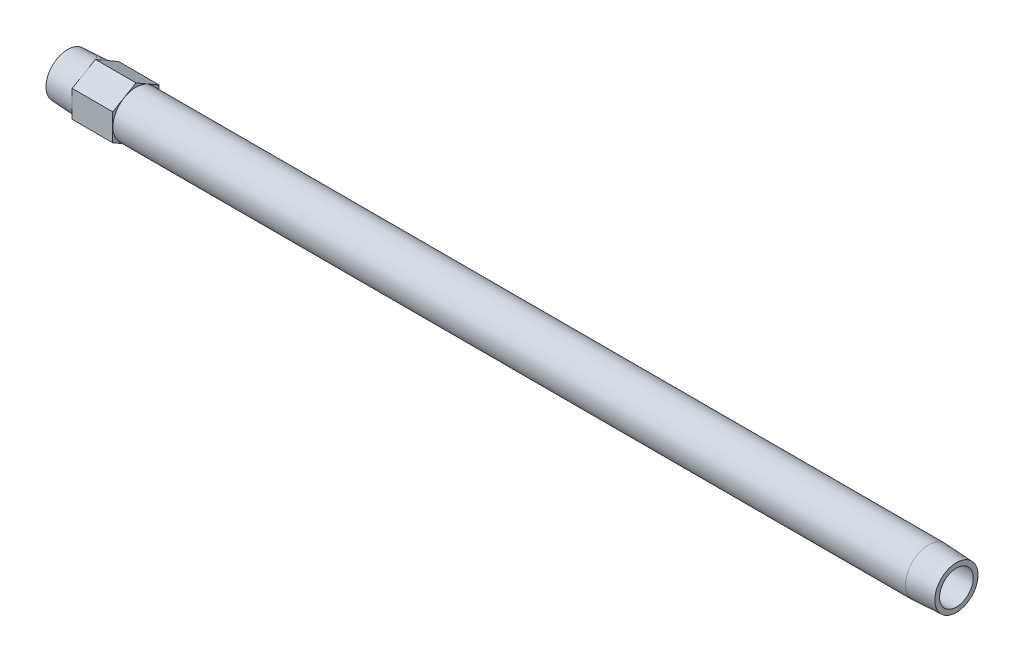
ISO-10303-21;
HEADER;
FILE_DESCRIPTION(('STEP AP214'),'2;1');
FILE_NAME('part.step','',(''),(''),'','','');
FILE_SCHEMA(('AUTOMOTIVE_DESIGN { 1 0 10303 214 1 1 1 1 }'));
ENDSEC;
DATA;
#1=APPLICATION_CONTEXT('core data for automotive mechanical design processes');
#2=APPLICATION_PROTOCOL_DEFINITION('international standard','automotive_design',2000,#1);
#3=PRODUCT_CONTEXT('',#1,'mechanical');
#4=PRODUCT('Part','Part','',(#3));
#5=PRODUCT_RELATED_PRODUCT_CATEGORY('part','',(#4));
#6=PRODUCT_DEFINITION_FORMATION('','',#4);
#7=PRODUCT_DEFINITION_CONTEXT('part definition',#1,'design');
#8=PRODUCT_DEFINITION('design','',#6,#7);
#9=PRODUCT_DEFINITION_SHAPE('','',#8);
#10=(LENGTH_UNIT() NAMED_UNIT(*) SI_UNIT(.MILLI.,.METRE.));
#11=(NAMED_UNIT(*) PLANE_ANGLE_UNIT() SI_UNIT($,.RADIAN.));
#12=(NAMED_UNIT(*) SI_UNIT($,.STERADIAN.) SOLID_ANGLE_UNIT());
#13=UNCERTAINTY_MEASURE_WITH_UNIT(LENGTH_MEASURE(1.E-05),#10,'distance_accuracy_value','');
#14=(GEOMETRIC_REPRESENTATION_CONTEXT(3) GLOBAL_UNCERTAINTY_ASSIGNED_CONTEXT((#13)) GLOBAL_UNIT_ASSIGNED_CONTEXT((#10,
#11,#12)) REPRESENTATION_CONTEXT('',''));
#15=CARTESIAN_POINT('',(0.,0.,0.));
#16=DIRECTION('',(0.,0.,1.));
#17=DIRECTION('',(1.,0.,0.));
#18=AXIS2_PLACEMENT_3D('',#15,#16,#17);
#19=CARTESIAN_POINT('',(0.,0.,-8.03071885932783));
#20=DIRECTION('',(1.,0.,0.));
#21=DIRECTION('',(0.,0.,-1.));
#22=AXIS2_PLACEMENT_3D('',#19,#20,#21);
#23=PLANE('',#22);
#24=CARTESIAN_POINT('',(0.,0.,0.));
#25=DIRECTION('',(-1.,0.,0.));
#26=DIRECTION('',(0.,0.,1.));
#27=AXIS2_PLACEMENT_3D('',#24,#25,#26);
#28=CIRCLE('',#27,8.03071885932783);
#29=CARTESIAN_POINT('',(0.,0.,8.03071885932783));
#30=VERTEX_POINT('',#29);
#31=EDGE_CURVE('E147',#30,#30,#28,.T.);
#32=ORIENTED_EDGE('',*,*,#31,.T.);
#33=EDGE_LOOP('',(#32));
#34=FACE_BOUND('',#33,.T.);
#35=CARTESIAN_POINT('',(0.,0.,0.));
#36=DIRECTION('',(1.,0.,0.));
#37=DIRECTION('',(0.,0.,1.));
#38=AXIS2_PLACEMENT_3D('',#35,#36,#37);
#39=CIRCLE('',#38,6.2611);
#40=CARTESIAN_POINT('',(0.,0.,6.2611));
#41=VERTEX_POINT('',#40);
#42=EDGE_CURVE('E159',#41,#41,#39,.T.);
#43=ORIENTED_EDGE('',*,*,#42,.T.);
#44=EDGE_LOOP('',(#43));
#45=FACE_BOUND('',#44,.T.);
#46=ADVANCED_FACE('F15',(#34,#45),#23,.F.);
#47=CARTESIAN_POINT('',(330.2,0.,-8.0307188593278));
#48=DIRECTION('',(-1.,0.,0.));
#49=DIRECTION('',(0.,0.,1.));
#50=AXIS2_PLACEMENT_3D('',#47,#48,#49);
#51=PLANE('',#50);
#52=CARTESIAN_POINT('',(330.2,0.,0.));
#53=DIRECTION('',(-1.,0.,0.));
#54=DIRECTION('',(0.,0.,1.));
#55=AXIS2_PLACEMENT_3D('',#52,#53,#54);
#56=CIRCLE('',#55,8.0307188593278);
#57=CARTESIAN_POINT('',(330.2,0.,8.0307188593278));
#58=VERTEX_POINT('',#57);
#59=EDGE_CURVE('E150',#58,#58,#56,.T.);
#60=ORIENTED_EDGE('',*,*,#59,.F.);
#61=EDGE_LOOP('',(#60));
#62=FACE_BOUND('',#61,.T.);
#63=CARTESIAN_POINT('',(330.2,0.,0.));
#64=DIRECTION('',(-1.,0.,0.));
#65=DIRECTION('',(0.,0.,1.));
#66=AXIS2_PLACEMENT_3D('',#63,#64,#65);
#67=CIRCLE('',#66,6.2611);
#68=CARTESIAN_POINT('',(330.2,0.,6.2611));
#69=VERTEX_POINT('',#68);
#70=EDGE_CURVE('E156',#69,#69,#67,.F.);
#71=ORIENTED_EDGE('',*,*,#70,.F.);
#72=EDGE_LOOP('',(#71));
#73=FACE_BOUND('',#72,.T.);
#74=ADVANCED_FACE('F178',(#62,#73),#51,.F.);
#75=CARTESIAN_POINT('',(25.4,-4.9859969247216,-8.636));
#76=DIRECTION('',(1.,0.,0.));
#77=DIRECTION('',(0.,1.,0.));
#78=AXIS2_PLACEMENT_3D('',#75,#76,#77);
#79=PLANE('',#78);
#80=DIRECTION('',(0.,0.5,-0.866025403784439));
#81=VECTOR('',#80,1.);
#82=CARTESIAN_POINT('',(25.4,-9.97199384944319,0.));
#83=LINE('',#82,#81);
#84=CARTESIAN_POINT('',(25.4,-9.97199384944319,0.));
#85=VERTEX_POINT('',#84);
#86=CARTESIAN_POINT('',(25.4,-4.9859969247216,-8.636));
#87=VERTEX_POINT('',#86);
#88=EDGE_CURVE('E103',#85,#87,#83,.T.);
#89=ORIENTED_EDGE('',*,*,#88,.T.);
#90=DIRECTION('',(0.,1.,0.));
#91=VECTOR('',#90,1.);
#92=CARTESIAN_POINT('',(25.4,-4.9859969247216,-8.636));
#93=LINE('',#92,#91);
#94=CARTESIAN_POINT('',(25.4,4.9859969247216,-8.636));
#95=VERTEX_POINT('',#94);
#96=EDGE_CURVE('E83',#87,#95,#93,.T.);
#97=ORIENTED_EDGE('',*,*,#96,.T.);
#98=DIRECTION('',(0.,0.5,0.866025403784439));
#99=VECTOR('',#98,1.);
#100=CARTESIAN_POINT('',(25.4,4.9859969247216,-8.636));
#101=LINE('',#100,#99);
#102=CARTESIAN_POINT('',(25.4,9.97199384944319,0.));
#103=VERTEX_POINT('',#102);
#104=EDGE_CURVE('E102',#95,#103,#101,.T.);
#105=ORIENTED_EDGE('',*,*,#104,.T.);
#106=DIRECTION('',(0.,-0.5,0.866025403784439));
#107=VECTOR('',#106,1.);
#108=CARTESIAN_POINT('',(25.4,9.97199384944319,0.));
#109=LINE('',#108,#107);
#110=CARTESIAN_POINT('',(25.4,4.9859969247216,8.636));
#111=VERTEX_POINT('',#110);
#112=EDGE_CURVE('E105',#103,#111,#109,.T.);
#113=ORIENTED_EDGE('',*,*,#112,.T.);
#114=DIRECTION('',(0.,-1.,0.));
#115=VECTOR('',#114,1.);
#116=CARTESIAN_POINT('',(25.4,4.9859969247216,8.636));
#117=LINE('',#116,#115);
#118=CARTESIAN_POINT('',(25.4,-4.9859969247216,8.636));
#119=VERTEX_POINT('',#118);
#120=EDGE_CURVE('E35',#111,#119,#117,.T.);
#121=ORIENTED_EDGE('',*,*,#120,.T.);
#122=DIRECTION('',(0.,-0.5,-0.866025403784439));
#123=VECTOR('',#122,1.);
#124=CARTESIAN_POINT('',(25.4,-4.9859969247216,8.636));
#125=LINE('',#124,#123);
#126=EDGE_CURVE('E30',#119,#85,#125,.T.);
#127=ORIENTED_EDGE('',*,*,#126,.T.);
#128=EDGE_LOOP('',(#89,#97,#105,#113,#121,#127));
#129=FACE_BOUND('',#128,.T.);
#130=CARTESIAN_POINT('',(25.4,0.,0.));
#131=DIRECTION('',(1.,0.,0.));
#132=DIRECTION('',(0.,1.,0.));
#133=AXIS2_PLACEMENT_3D('',#130,#131,#132);
#134=CIRCLE('',#133,8.5725);
#135=CARTESIAN_POINT('',(25.4,8.5725,0.));
#136=VERTEX_POINT('',#135);
#137=EDGE_CURVE('E89',#136,#136,#134,.F.);
#138=ORIENTED_EDGE('',*,*,#137,.T.);
#139=EDGE_LOOP('',(#138));
#140=FACE_BOUND('',#139,.T.);
#141=ADVANCED_FACE('F124',(#129,#140),#79,.T.);
#142=CARTESIAN_POINT('',(10.3378,-4.9859969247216,-8.636));
#143=DIRECTION('',(1.,0.,0.));
#144=DIRECTION('',(0.,1.,0.));
#145=AXIS2_PLACEMENT_3D('',#142,#143,#144);
#146=PLANE('',#145);
#147=DIRECTION('',(0.,0.5,-0.866025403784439));
#148=VECTOR('',#147,1.);
#149=CARTESIAN_POINT('',(10.3378,-9.97199384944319,0.));
#150=LINE('',#149,#148);
#151=CARTESIAN_POINT('',(10.3378,-9.97199384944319,0.));
#152=VERTEX_POINT('',#151);
#153=CARTESIAN_POINT('',(10.3378,-4.9859969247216,-8.636));
#154=VERTEX_POINT('',#153);
#155=EDGE_CURVE('E73',#152,#154,#150,.T.);
#156=ORIENTED_EDGE('',*,*,#155,.F.);
#157=DIRECTION('',(0.,-0.5,-0.866025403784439));
#158=VECTOR('',#157,1.);
#159=CARTESIAN_POINT('',(10.3378,-4.9859969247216,8.636));
#160=LINE('',#159,#158);
#161=CARTESIAN_POINT('',(10.3378,-4.9859969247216,8.636));
#162=VERTEX_POINT('',#161);
#163=EDGE_CURVE('E99',#162,#152,#160,.T.);
#164=ORIENTED_EDGE('',*,*,#163,.F.);
#165=DIRECTION('',(0.,-1.,0.));
#166=VECTOR('',#165,1.);
#167=CARTESIAN_POINT('',(10.3378,4.9859969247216,8.636));
#168=LINE('',#167,#166);
#169=CARTESIAN_POINT('',(10.3378,4.9859969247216,8.636));
#170=VERTEX_POINT('',#169);
#171=EDGE_CURVE('E133',#170,#162,#168,.T.);
#172=ORIENTED_EDGE('',*,*,#171,.F.);
#173=DIRECTION('',(0.,-0.5,0.866025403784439));
#174=VECTOR('',#173,1.);
#175=CARTESIAN_POINT('',(10.3378,9.97199384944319,0.));
#176=LINE('',#175,#174);
#177=CARTESIAN_POINT('',(10.3378,9.97199384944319,0.));
#178=VERTEX_POINT('',#177);
#179=EDGE_CURVE('E129',#178,#170,#176,.T.);
#180=ORIENTED_EDGE('',*,*,#179,.F.);
#181=DIRECTION('',(0.,0.5,0.866025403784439));
#182=VECTOR('',#181,1.);
#183=CARTESIAN_POINT('',(10.3378,4.9859969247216,-8.636));
#184=LINE('',#183,#182);
#185=CARTESIAN_POINT('',(10.3378,4.9859969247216,-8.636));
#186=VERTEX_POINT('',#185);
#187=EDGE_CURVE('E75',#186,#178,#184,.T.);
#188=ORIENTED_EDGE('',*,*,#187,.F.);
#189=DIRECTION('',(0.,1.,0.));
#190=VECTOR('',#189,1.);
#191=CARTESIAN_POINT('',(10.3378,-4.9859969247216,-8.636));
#192=LINE('',#191,#190);
#193=EDGE_CURVE('E68',#154,#186,#192,.T.);
#194=ORIENTED_EDGE('',*,*,#193,.F.);
#195=EDGE_LOOP('',(#156,#164,#172,#180,#188,#194));
#196=FACE_BOUND('',#195,.T.);
#197=CARTESIAN_POINT('',(10.3378,0.,0.));
#198=DIRECTION('',(-1.,0.,0.));
#199=DIRECTION('',(0.,0.,1.));
#200=AXIS2_PLACEMENT_3D('',#197,#198,#199);
#201=CIRCLE('',#200,8.5725);
#202=CARTESIAN_POINT('',(10.3378,0.,8.5725));
#203=VERTEX_POINT('',#202);
#204=EDGE_CURVE('E95',#203,#203,#201,.T.);
#205=ORIENTED_EDGE('',*,*,#204,.F.);
#206=EDGE_LOOP('',(#205));
#207=FACE_BOUND('',#206,.T.);
#208=ADVANCED_FACE('F69',(#196,#207),#146,.F.);
#209=CARTESIAN_POINT('',(25.4,-9.97199384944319,0.));
#210=DIRECTION('',(0.,0.866025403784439,0.5));
#211=DIRECTION('',(0.,-0.5,0.866025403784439));
#212=AXIS2_PLACEMENT_3D('',#209,#210,#211);
#213=PLANE('',#212);
#214=ORIENTED_EDGE('',*,*,#155,.T.);
#215=DIRECTION('',(-1.,0.,0.));
#216=VECTOR('',#215,1.);
#217=CARTESIAN_POINT('',(25.4,-4.9859969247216,-8.636));
#218=LINE('',#217,#216);
#219=EDGE_CURVE('E10',#87,#154,#218,.T.);
#220=ORIENTED_EDGE('',*,*,#219,.F.);
#221=ORIENTED_EDGE('',*,*,#88,.F.);
#222=DIRECTION('',(-1.,0.,0.));
#223=VECTOR('',#222,1.);
#224=CARTESIAN_POINT('',(25.4,-9.97199384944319,0.));
#225=LINE('',#224,#223);
#226=EDGE_CURVE('E87',#85,#152,#225,.T.);
#227=ORIENTED_EDGE('',*,*,#226,.T.);
#228=EDGE_LOOP('',(#214,#220,#221,#227));
#229=FACE_BOUND('',#228,.T.);
#230=ADVANCED_FACE('F17',(#229),#213,.F.);
#231=CARTESIAN_POINT('',(25.4,-4.9859969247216,-8.636));
#232=DIRECTION('',(0.,0.,1.));
#233=DIRECTION('',(1.,0.,0.));
#234=AXIS2_PLACEMENT_3D('',#231,#232,#233);
#235=PLANE('',#234);
#236=ORIENTED_EDGE('',*,*,#193,.T.);
#237=DIRECTION('',(-1.,0.,0.));
#238=VECTOR('',#237,1.);
#239=CARTESIAN_POINT('',(25.4,4.9859969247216,-8.636));
#240=LINE('',#239,#238);
#241=EDGE_CURVE('E23',#95,#186,#240,.T.);
#242=ORIENTED_EDGE('',*,*,#241,.F.);
#243=ORIENTED_EDGE('',*,*,#96,.F.);
#244=ORIENTED_EDGE('',*,*,#219,.T.);
#245=EDGE_LOOP('',(#236,#242,#243,#244));
#246=FACE_BOUND('',#245,.T.);
#247=ADVANCED_FACE('F82',(#246),#235,.F.);
#248=CARTESIAN_POINT('',(25.4,4.9859969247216,-8.636));
#249=DIRECTION('',(0.,-0.866025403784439,0.5));
#250=DIRECTION('',(0.,-0.5,-0.866025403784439));
#251=AXIS2_PLACEMENT_3D('',#248,#249,#250);
#252=PLANE('',#251);
#253=ORIENTED_EDGE('',*,*,#187,.T.);
#254=DIRECTION('',(-1.,0.,0.));
#255=VECTOR('',#254,1.);
#256=CARTESIAN_POINT('',(25.4,9.97199384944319,0.));
#257=LINE('',#256,#255);
#258=EDGE_CURVE('E117',#103,#178,#257,.T.);
#259=ORIENTED_EDGE('',*,*,#258,.F.);
#260=ORIENTED_EDGE('',*,*,#104,.F.);
#261=ORIENTED_EDGE('',*,*,#241,.T.);
#262=EDGE_LOOP('',(#253,#259,#260,#261));
#263=FACE_BOUND('',#262,.T.);
#264=ADVANCED_FACE('F121',(#263),#252,.F.);
#265=CARTESIAN_POINT('',(25.4,9.97199384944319,0.));
#266=DIRECTION('',(0.,-0.866025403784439,-0.5));
#267=DIRECTION('',(0.,0.5,-0.866025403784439));
#268=AXIS2_PLACEMENT_3D('',#265,#266,#267);
#269=PLANE('',#268);
#270=ORIENTED_EDGE('',*,*,#179,.T.);
#271=DIRECTION('',(-1.,0.,0.));
#272=VECTOR('',#271,1.);
#273=CARTESIAN_POINT('',(25.4,4.9859969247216,8.636));
#274=LINE('',#273,#272);
#275=EDGE_CURVE('E114',#111,#170,#274,.T.);
#276=ORIENTED_EDGE('',*,*,#275,.F.);
#277=ORIENTED_EDGE('',*,*,#112,.F.);
#278=ORIENTED_EDGE('',*,*,#258,.T.);
#279=EDGE_LOOP('',(#270,#276,#277,#278));
#280=FACE_BOUND('',#279,.T.);
#281=ADVANCED_FACE('F128',(#280),#269,.F.);
#282=CARTESIAN_POINT('',(25.4,4.9859969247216,8.636));
#283=DIRECTION('',(0.,0.,-1.));
#284=DIRECTION('',(-1.,0.,0.));
#285=AXIS2_PLACEMENT_3D('',#282,#283,#284);
#286=PLANE('',#285);
#287=ORIENTED_EDGE('',*,*,#171,.T.);
#288=DIRECTION('',(-1.,0.,0.));
#289=VECTOR('',#288,1.);
#290=CARTESIAN_POINT('',(25.4,-4.9859969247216,8.636));
#291=LINE('',#290,#289);
#292=EDGE_CURVE('E111',#119,#162,#291,.T.);
#293=ORIENTED_EDGE('',*,*,#292,.F.);
#294=ORIENTED_EDGE('',*,*,#120,.F.);
#295=ORIENTED_EDGE('',*,*,#275,.T.);
#296=EDGE_LOOP('',(#287,#293,#294,#295));
#297=FACE_BOUND('',#296,.T.);
#298=ADVANCED_FACE('F132',(#297),#286,.F.);
#299=CARTESIAN_POINT('',(25.4,-4.9859969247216,8.636));
#300=DIRECTION('',(0.,0.866025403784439,-0.5));
#301=DIRECTION('',(0.,0.5,0.866025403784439));
#302=AXIS2_PLACEMENT_3D('',#299,#300,#301);
#303=PLANE('',#302);
#304=ORIENTED_EDGE('',*,*,#163,.T.);
#305=ORIENTED_EDGE('',*,*,#226,.F.);
#306=ORIENTED_EDGE('',*,*,#126,.F.);
#307=ORIENTED_EDGE('',*,*,#292,.T.);
#308=EDGE_LOOP('',(#304,#305,#306,#307));
#309=FACE_BOUND('',#308,.T.);
#310=ADVANCED_FACE('F135',(#309),#303,.F.);
#311=CARTESIAN_POINT('',(10.3378,0.,0.));
#312=DIRECTION('',(1.,0.,0.));
#313=DIRECTION('',(0.,0.,-1.));
#314=AXIS2_PLACEMENT_3D('',#311,#312,#313);
#315=CONICAL_SURFACE('',#314,8.5725,0.0523598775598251);
#316=ORIENTED_EDGE('',*,*,#31,.F.);
#317=EDGE_LOOP('',(#316));
#318=FACE_BOUND('',#317,.T.);
#319=ORIENTED_EDGE('',*,*,#204,.T.);
#320=EDGE_LOOP('',(#319));
#321=FACE_BOUND('',#320,.T.);
#322=ADVANCED_FACE('F187',(#318,#321),#315,.T.);
#323=CARTESIAN_POINT('',(-60.,0.,0.));
#324=DIRECTION('',(-1.,0.,0.));
#325=DIRECTION('',(0.,0.,1.));
#326=AXIS2_PLACEMENT_3D('',#323,#324,#325);
#327=CYLINDRICAL_SURFACE('',#326,8.5725);
#328=ORIENTED_EDGE('',*,*,#137,.F.);
#329=EDGE_LOOP('',(#328));
#330=FACE_BOUND('',#329,.T.);
#331=CARTESIAN_POINT('',(319.8622,0.,0.));
#332=DIRECTION('',(-1.,0.,0.));
#333=DIRECTION('',(0.,0.,1.));
#334=AXIS2_PLACEMENT_3D('',#331,#332,#333);
#335=CIRCLE('',#334,8.5725);
#336=CARTESIAN_POINT('',(319.8622,0.,8.5725));
#337=VERTEX_POINT('',#336);
#338=EDGE_CURVE('E153',#337,#337,#335,.T.);
#339=ORIENTED_EDGE('',*,*,#338,.T.);
#340=EDGE_LOOP('',(#339));
#341=FACE_BOUND('',#340,.T.);
#342=ADVANCED_FACE('F174',(#330,#341),#327,.T.);
#343=CARTESIAN_POINT('',(330.2,0.,0.));
#344=DIRECTION('',(-1.,0.,0.));
#345=DIRECTION('',(0.,0.,1.));
#346=AXIS2_PLACEMENT_3D('',#343,#344,#345);
#347=CONICAL_SURFACE('',#346,8.0307188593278,0.0523598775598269);
#348=ORIENTED_EDGE('',*,*,#338,.F.);
#349=EDGE_LOOP('',(#348));
#350=FACE_BOUND('',#349,.T.);
#351=ORIENTED_EDGE('',*,*,#59,.T.);
#352=EDGE_LOOP('',(#351));
#353=FACE_BOUND('',#352,.T.);
#354=ADVANCED_FACE('F167',(#350,#353),#347,.T.);
#355=CARTESIAN_POINT('',(331.252357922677,0.,0.));
#356=DIRECTION('',(-1.,0.,0.));
#357=DIRECTION('',(0.,0.,1.));
#358=AXIS2_PLACEMENT_3D('',#355,#356,#357);
#359=CYLINDRICAL_SURFACE('',#358,6.2611);
#360=ORIENTED_EDGE('',*,*,#70,.T.);
#361=EDGE_LOOP('',(#360));
#362=FACE_BOUND('',#361,.T.);
#363=ORIENTED_EDGE('',*,*,#42,.F.);
#364=EDGE_LOOP('',(#363));
#365=FACE_BOUND('',#364,.T.);
#366=ADVANCED_FACE('F165',(#362,#365),#359,.F.);
#367=CLOSED_SHELL('',(#46,#74,#141,#208,#230,#247,#264,#281,#298,#310,#322,#342,#354,#366));
#368=MANIFOLD_SOLID_BREP('B1',#367);
#369=ADVANCED_BREP_SHAPE_REPRESENTATION('',(#18,#368),#14);
#370=SHAPE_DEFINITION_REPRESENTATION(#9,#369);
ENDSEC;
END-ISO-10303-21;
